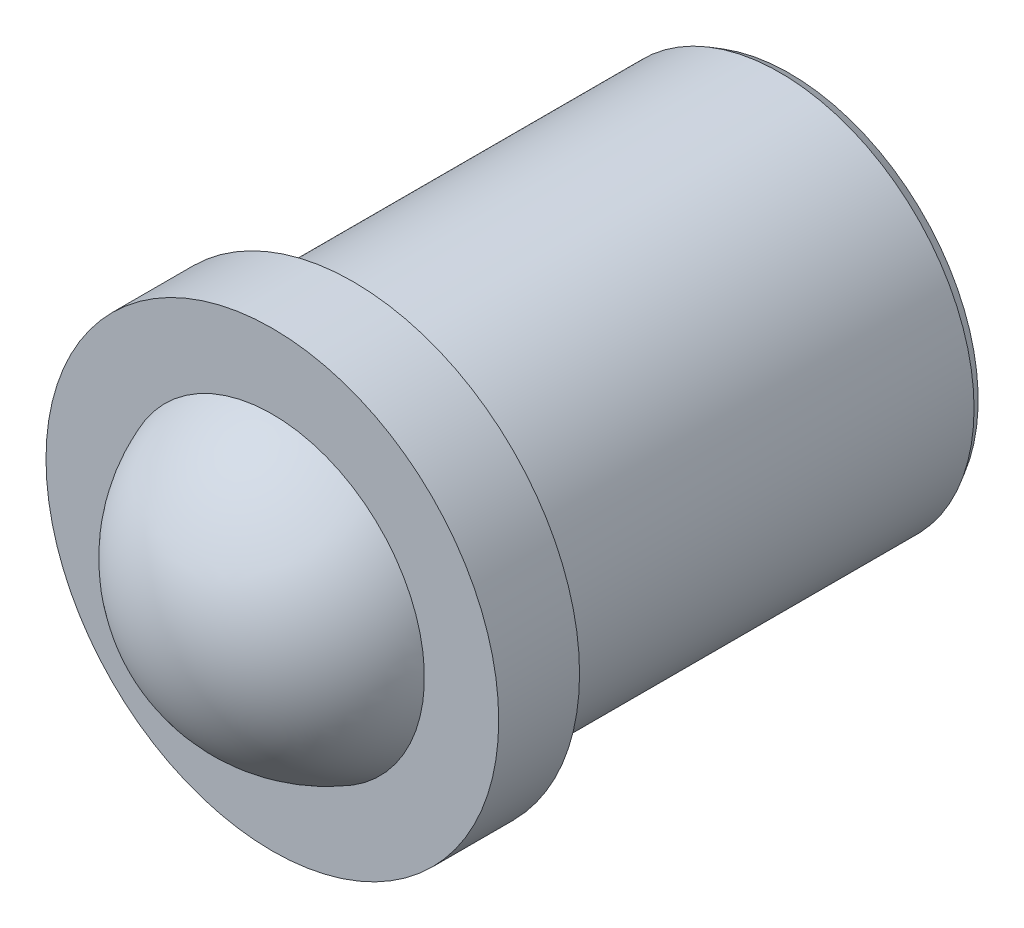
ISO-10303-21;
HEADER;
FILE_DESCRIPTION(('STEP AP214'),'2;1');
FILE_NAME('part.step','',(''),(''),'','','');
FILE_SCHEMA(('AUTOMOTIVE_DESIGN { 1 0 10303 214 1 1 1 1 }'));
ENDSEC;
DATA;
#1=APPLICATION_CONTEXT('core data for automotive mechanical design processes');
#2=APPLICATION_PROTOCOL_DEFINITION('international standard','automotive_design',2000,#1);
#3=PRODUCT_CONTEXT('',#1,'mechanical');
#4=PRODUCT('Part','Part','',(#3));
#5=PRODUCT_RELATED_PRODUCT_CATEGORY('part','',(#4));
#6=PRODUCT_DEFINITION_FORMATION('','',#4);
#7=PRODUCT_DEFINITION_CONTEXT('part definition',#1,'design');
#8=PRODUCT_DEFINITION('design','',#6,#7);
#9=PRODUCT_DEFINITION_SHAPE('','',#8);
#10=(LENGTH_UNIT() NAMED_UNIT(*) SI_UNIT(.MILLI.,.METRE.));
#11=(NAMED_UNIT(*) PLANE_ANGLE_UNIT() SI_UNIT($,.RADIAN.));
#12=(NAMED_UNIT(*) SI_UNIT($,.STERADIAN.) SOLID_ANGLE_UNIT());
#13=UNCERTAINTY_MEASURE_WITH_UNIT(LENGTH_MEASURE(1.E-05),#10,'distance_accuracy_value','');
#14=(GEOMETRIC_REPRESENTATION_CONTEXT(3) GLOBAL_UNCERTAINTY_ASSIGNED_CONTEXT((#13)) GLOBAL_UNIT_ASSIGNED_CONTEXT((#10,
#11,#12)) REPRESENTATION_CONTEXT('',''));
#15=CARTESIAN_POINT('',(0.,0.,0.));
#16=DIRECTION('',(0.,0.,1.));
#17=DIRECTION('',(1.,0.,0.));
#18=AXIS2_PLACEMENT_3D('',#15,#16,#17);
#19=CARTESIAN_POINT('',(0.,0.,-13.5));
#20=DIRECTION('',(0.,0.,1.));
#21=DIRECTION('',(-1.,0.,0.));
#22=AXIS2_PLACEMENT_3D('',#19,#20,#21);
#23=PLANE('',#22);
#24=CARTESIAN_POINT('',(0.,0.,-13.5));
#25=DIRECTION('',(0.,0.,1.));
#26=DIRECTION('',(-1.,0.,0.));
#27=AXIS2_PLACEMENT_3D('',#24,#25,#26);
#28=CIRCLE('',#27,5.82679491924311);
#29=CARTESIAN_POINT('',(-5.82679491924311,0.,-13.5));
#30=VERTEX_POINT('',#29);
#31=EDGE_CURVE('E18',#30,#30,#28,.T.);
#32=ORIENTED_EDGE('',*,*,#31,.F.);
#33=EDGE_LOOP('',(#32));
#34=FACE_BOUND('',#33,.T.);
#35=ADVANCED_FACE('F12',(#34),#23,.F.);
#36=CARTESIAN_POINT('',(0.,0.,-13.5));
#37=DIRECTION('',(0.,0.,1.));
#38=DIRECTION('',(-1.,0.,0.));
#39=AXIS2_PLACEMENT_3D('',#36,#37,#38);
#40=CONICAL_SURFACE('',#39,5.82679491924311,0.523598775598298);
#41=CARTESIAN_POINT('',(0.,0.,-13.2));
#42=DIRECTION('',(0.,0.,1.));
#43=DIRECTION('',(-1.,0.,0.));
#44=AXIS2_PLACEMENT_3D('',#41,#42,#43);
#45=CIRCLE('',#44,6.);
#46=CARTESIAN_POINT('',(-6.,0.,-13.2));
#47=VERTEX_POINT('',#46);
#48=EDGE_CURVE('E22',#47,#47,#45,.T.);
#49=ORIENTED_EDGE('',*,*,#48,.F.);
#50=EDGE_LOOP('',(#49));
#51=FACE_BOUND('',#50,.T.);
#52=ORIENTED_EDGE('',*,*,#31,.T.);
#53=EDGE_LOOP('',(#52));
#54=FACE_BOUND('',#53,.T.);
#55=ADVANCED_FACE('F55',(#51,#54),#40,.T.);
#56=CARTESIAN_POINT('',(0.,0.,2.5));
#57=DIRECTION('',(0.,0.,1.));
#58=DIRECTION('',(-1.,0.,0.));
#59=AXIS2_PLACEMENT_3D('',#56,#57,#58);
#60=CYLINDRICAL_SURFACE('',#59,6.);
#61=CARTESIAN_POINT('',(0.,0.,0.));
#62=DIRECTION('',(0.,0.,1.));
#63=DIRECTION('',(-1.,0.,0.));
#64=AXIS2_PLACEMENT_3D('',#61,#62,#63);
#65=CIRCLE('',#64,6.);
#66=CARTESIAN_POINT('',(-6.,0.,0.));
#67=VERTEX_POINT('',#66);
#68=EDGE_CURVE('E26',#67,#67,#65,.T.);
#69=ORIENTED_EDGE('',*,*,#68,.F.);
#70=EDGE_LOOP('',(#69));
#71=FACE_BOUND('',#70,.T.);
#72=ORIENTED_EDGE('',*,*,#48,.T.);
#73=EDGE_LOOP('',(#72));
#74=FACE_BOUND('',#73,.T.);
#75=ADVANCED_FACE('F49',(#71,#74),#60,.T.);
#76=CARTESIAN_POINT('',(-6.,0.,0.));
#77=DIRECTION('',(0.,0.,1.));
#78=DIRECTION('',(-1.,0.,0.));
#79=AXIS2_PLACEMENT_3D('',#76,#77,#78);
#80=PLANE('',#79);
#81=CARTESIAN_POINT('',(0.,0.,0.));
#82=DIRECTION('',(0.,0.,1.));
#83=DIRECTION('',(-1.,0.,0.));
#84=AXIS2_PLACEMENT_3D('',#81,#82,#83);
#85=CIRCLE('',#84,7.);
#86=CARTESIAN_POINT('',(-7.,0.,0.));
#87=VERTEX_POINT('',#86);
#88=EDGE_CURVE('E31',#87,#87,#85,.T.);
#89=ORIENTED_EDGE('',*,*,#88,.F.);
#90=EDGE_LOOP('',(#89));
#91=FACE_BOUND('',#90,.T.);
#92=ORIENTED_EDGE('',*,*,#68,.T.);
#93=EDGE_LOOP('',(#92));
#94=FACE_BOUND('',#93,.T.);
#95=ADVANCED_FACE('F43',(#91,#94),#80,.F.);
#96=CARTESIAN_POINT('',(0.,0.,2.5));
#97=DIRECTION('',(0.,0.,1.));
#98=DIRECTION('',(-1.,0.,0.));
#99=AXIS2_PLACEMENT_3D('',#96,#97,#98);
#100=CYLINDRICAL_SURFACE('',#99,7.);
#101=CARTESIAN_POINT('',(0.,0.,2.5));
#102=DIRECTION('',(0.,0.,1.));
#103=DIRECTION('',(-1.,0.,0.));
#104=AXIS2_PLACEMENT_3D('',#101,#102,#103);
#105=CIRCLE('',#104,7.);
#106=CARTESIAN_POINT('',(-7.,0.,2.5));
#107=VERTEX_POINT('',#106);
#108=EDGE_CURVE('E34',#107,#107,#105,.T.);
#109=ORIENTED_EDGE('',*,*,#108,.F.);
#110=EDGE_LOOP('',(#109));
#111=FACE_BOUND('',#110,.T.);
#112=ORIENTED_EDGE('',*,*,#88,.T.);
#113=EDGE_LOOP('',(#112));
#114=FACE_BOUND('',#113,.T.);
#115=ADVANCED_FACE('F40',(#111,#114),#100,.T.);
#116=CARTESIAN_POINT('',(-7.,0.,2.5));
#117=DIRECTION('',(0.,0.,-1.));
#118=DIRECTION('',(1.,0.,0.));
#119=AXIS2_PLACEMENT_3D('',#116,#117,#118);
#120=PLANE('',#119);
#121=ORIENTED_EDGE('',*,*,#108,.T.);
#122=EDGE_LOOP('',(#121));
#123=FACE_BOUND('',#122,.T.);
#124=CARTESIAN_POINT('',(0.,0.,2.5));
#125=DIRECTION('',(0.,0.,1.));
#126=DIRECTION('',(-1.,0.,0.));
#127=AXIS2_PLACEMENT_3D('',#124,#125,#126);
#128=CIRCLE('',#127,4.7021271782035);
#129=CARTESIAN_POINT('',(-4.7021271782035,0.,2.5));
#130=VERTEX_POINT('',#129);
#131=EDGE_CURVE('E8',#130,#130,#128,.F.);
#132=ORIENTED_EDGE('',*,*,#131,.T.);
#133=EDGE_LOOP('',(#132));
#134=FACE_BOUND('',#133,.T.);
#135=ADVANCED_FACE('F38',(#123,#134),#120,.F.);
#136=CARTESIAN_POINT('',(0.,0.,0.8));
#137=DIRECTION('',(0.,0.,-1.));
#138=DIRECTION('',(-1.,0.,0.));
#139=AXIS2_PLACEMENT_3D('',#136,#137,#138);
#140=SPHERICAL_SURFACE('',#139,5.);
#141=ORIENTED_EDGE('',*,*,#131,.F.);
#142=EDGE_LOOP('',(#141));
#143=FACE_BOUND('',#142,.T.);
#144=ADVANCED_FACE('F68',(#143),#140,.T.);
#145=CLOSED_SHELL('',(#35,#55,#75,#95,#115,#135,#144));
#146=MANIFOLD_SOLID_BREP('B1',#145);
#147=ADVANCED_BREP_SHAPE_REPRESENTATION('',(#18,#146),#14);
#148=SHAPE_DEFINITION_REPRESENTATION(#9,#147);
ENDSEC;
END-ISO-10303-21;
